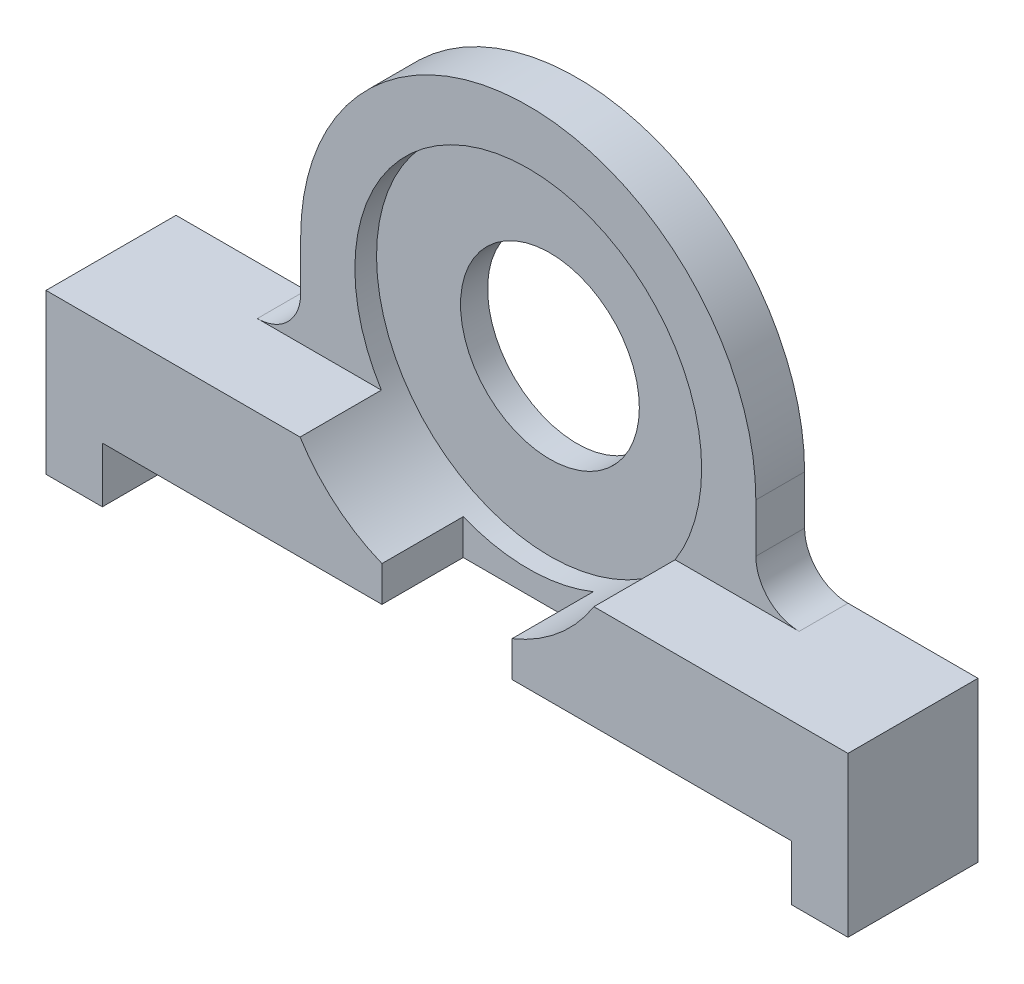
ISO-10303-21;
HEADER;
FILE_DESCRIPTION(('STEP AP214'),'2;1');
FILE_NAME('part.step','',(''),(''),'','','');
FILE_SCHEMA(('AUTOMOTIVE_DESIGN { 1 0 10303 214 1 1 1 1 }'));
ENDSEC;
DATA;
#1=APPLICATION_CONTEXT('core data for automotive mechanical design processes');
#2=APPLICATION_PROTOCOL_DEFINITION('international standard','automotive_design',2000,#1);
#3=PRODUCT_CONTEXT('',#1,'mechanical');
#4=PRODUCT('Part','Part','',(#3));
#5=PRODUCT_RELATED_PRODUCT_CATEGORY('part','',(#4));
#6=PRODUCT_DEFINITION_FORMATION('','',#4);
#7=PRODUCT_DEFINITION_CONTEXT('part definition',#1,'design');
#8=PRODUCT_DEFINITION('design','',#6,#7);
#9=PRODUCT_DEFINITION_SHAPE('','',#8);
#10=(LENGTH_UNIT() NAMED_UNIT(*) SI_UNIT(.MILLI.,.METRE.));
#11=(NAMED_UNIT(*) PLANE_ANGLE_UNIT() SI_UNIT($,.RADIAN.));
#12=(NAMED_UNIT(*) SI_UNIT($,.STERADIAN.) SOLID_ANGLE_UNIT());
#13=UNCERTAINTY_MEASURE_WITH_UNIT(LENGTH_MEASURE(1.E-05),#10,'distance_accuracy_value','');
#14=(GEOMETRIC_REPRESENTATION_CONTEXT(3) GLOBAL_UNCERTAINTY_ASSIGNED_CONTEXT((#13)) GLOBAL_UNIT_ASSIGNED_CONTEXT((#10,
#11,#12)) REPRESENTATION_CONTEXT('',''));
#15=CARTESIAN_POINT('',(0.,0.,0.));
#16=DIRECTION('',(0.,0.,1.));
#17=DIRECTION('',(1.,0.,0.));
#18=AXIS2_PLACEMENT_3D('',#15,#16,#17);
#19=CARTESIAN_POINT('',(0.,23.2,12.));
#20=DIRECTION('',(0.,0.,-1.));
#21=DIRECTION('',(-1.,0.,0.));
#22=AXIS2_PLACEMENT_3D('',#19,#20,#21);
#23=PLANE('',#22);
#24=DIRECTION('',(-1.,0.,0.));
#25=VECTOR('',#24,1.);
#26=CARTESIAN_POINT('',(-21.8,5.1,12.));
#27=LINE('',#26,#25);
#28=CARTESIAN_POINT('',(-6.,5.1,12.));
#29=VERTEX_POINT('',#28);
#30=CARTESIAN_POINT('',(-31.8,5.1,12.));
#31=VERTEX_POINT('',#30);
#32=EDGE_CURVE('E248',#29,#31,#27,.T.);
#33=ORIENTED_EDGE('',*,*,#32,.F.);
#34=DIRECTION('',(0.,-1.,0.));
#35=VECTOR('',#34,1.);
#36=CARTESIAN_POINT('',(-6.,5.1,12.));
#37=LINE('',#36,#35);
#38=CARTESIAN_POINT('',(-6.,8.36760302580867,12.));
#39=VERTEX_POINT('',#38);
#40=EDGE_CURVE('E235',#39,#29,#37,.T.);
#41=ORIENTED_EDGE('',*,*,#40,.F.);
#42=CARTESIAN_POINT('',(0.,23.2,12.));
#43=DIRECTION('',(0.,0.,1.));
#44=DIRECTION('',(1.,0.,0.));
#45=AXIS2_PLACEMENT_3D('',#42,#43,#44);
#46=CIRCLE('',#45,16.);
#47=CARTESIAN_POINT('',(-13.555441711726,14.7,12.));
#48=VERTEX_POINT('',#47);
#49=EDGE_CURVE('E301',#48,#39,#46,.T.);
#50=ORIENTED_EDGE('',*,*,#49,.F.);
#51=DIRECTION('',(-1.,0.,0.));
#52=VECTOR('',#51,1.);
#53=CARTESIAN_POINT('',(-21.,14.7,12.));
#54=LINE('',#53,#52);
#55=CARTESIAN_POINT('',(-37.,14.7,12.));
#56=VERTEX_POINT('',#55);
#57=EDGE_CURVE('E312',#48,#56,#54,.T.);
#58=ORIENTED_EDGE('',*,*,#57,.T.);
#59=DIRECTION('',(0.,-1.,0.));
#60=VECTOR('',#59,1.);
#61=CARTESIAN_POINT('',(-37.,14.7,12.));
#62=LINE('',#61,#60);
#63=CARTESIAN_POINT('',(-37.,0.,12.));
#64=VERTEX_POINT('',#63);
#65=EDGE_CURVE('E314',#56,#64,#62,.T.);
#66=ORIENTED_EDGE('',*,*,#65,.T.);
#67=DIRECTION('',(1.,0.,0.));
#68=VECTOR('',#67,1.);
#69=CARTESIAN_POINT('',(-37.,0.,12.));
#70=LINE('',#69,#68);
#71=CARTESIAN_POINT('',(-31.8,0.,12.));
#72=VERTEX_POINT('',#71);
#73=EDGE_CURVE('E304',#64,#72,#70,.T.);
#74=ORIENTED_EDGE('',*,*,#73,.T.);
#75=DIRECTION('',(0.,-1.,0.));
#76=VECTOR('',#75,1.);
#77=CARTESIAN_POINT('',(-31.8,0.,12.));
#78=LINE('',#77,#76);
#79=EDGE_CURVE('E257',#31,#72,#78,.T.);
#80=ORIENTED_EDGE('',*,*,#79,.F.);
#81=EDGE_LOOP('',(#33,#41,#50,#58,#66,#74,#80));
#82=FACE_BOUND('',#81,.T.);
#83=ADVANCED_FACE('F38',(#82),#23,.F.);
#84=CARTESIAN_POINT('',(21.,23.2,12.));
#85=DIRECTION('',(-1.,0.,0.));
#86=DIRECTION('',(0.,-1.,0.));
#87=AXIS2_PLACEMENT_3D('',#84,#85,#86);
#88=PLANE('',#87);
#89=DIRECTION('',(0.,-1.,0.));
#90=VECTOR('',#89,1.);
#91=CARTESIAN_POINT('',(21.,14.7,4.5));
#92=LINE('',#91,#90);
#93=CARTESIAN_POINT('',(21.,23.2,4.5));
#94=VERTEX_POINT('',#93);
#95=CARTESIAN_POINT('',(21.,18.7,4.5));
#96=VERTEX_POINT('',#95);
#97=EDGE_CURVE('E427',#94,#96,#92,.T.);
#98=ORIENTED_EDGE('',*,*,#97,.T.);
#99=DIRECTION('',(0.,0.,-1.));
#100=VECTOR('',#99,1.);
#101=CARTESIAN_POINT('',(21.,18.7,0.));
#102=LINE('',#101,#100);
#103=CARTESIAN_POINT('',(21.,18.7,0.));
#104=VERTEX_POINT('',#103);
#105=EDGE_CURVE('E384',#96,#104,#102,.T.);
#106=ORIENTED_EDGE('',*,*,#105,.T.);
#107=DIRECTION('',(0.,1.,0.));
#108=VECTOR('',#107,1.);
#109=CARTESIAN_POINT('',(21.,23.2,0.));
#110=LINE('',#109,#108);
#111=CARTESIAN_POINT('',(21.,23.2,0.));
#112=VERTEX_POINT('',#111);
#113=EDGE_CURVE('E325',#104,#112,#110,.T.);
#114=ORIENTED_EDGE('',*,*,#113,.T.);
#115=DIRECTION('',(0.,0.,-1.));
#116=VECTOR('',#115,1.);
#117=CARTESIAN_POINT('',(21.,23.2,12.));
#118=LINE('',#117,#116);
#119=EDGE_CURVE('E345',#94,#112,#118,.T.);
#120=ORIENTED_EDGE('',*,*,#119,.F.);
#121=EDGE_LOOP('',(#98,#106,#114,#120));
#122=FACE_BOUND('',#121,.T.);
#123=ADVANCED_FACE('F599',(#122),#88,.F.);
#124=CARTESIAN_POINT('',(0.,23.2,12.));
#125=DIRECTION('',(0.,0.,-1.));
#126=DIRECTION('',(-1.,0.,0.));
#127=AXIS2_PLACEMENT_3D('',#124,#125,#126);
#128=CYLINDRICAL_SURFACE('',#127,21.);
#129=CARTESIAN_POINT('',(0.,23.2,4.5));
#130=DIRECTION('',(0.,0.,1.));
#131=DIRECTION('',(1.,0.,0.));
#132=AXIS2_PLACEMENT_3D('',#129,#130,#131);
#133=CIRCLE('',#132,21.);
#134=CARTESIAN_POINT('',(-21.,23.2,4.5));
#135=VERTEX_POINT('',#134);
#136=EDGE_CURVE('E418',#135,#94,#133,.F.);
#137=ORIENTED_EDGE('',*,*,#136,.T.);
#138=ORIENTED_EDGE('',*,*,#119,.T.);
#139=CARTESIAN_POINT('',(0.,23.2,0.));
#140=DIRECTION('',(0.,0.,1.));
#141=DIRECTION('',(-1.,0.,0.));
#142=AXIS2_PLACEMENT_3D('',#139,#140,#141);
#143=CIRCLE('',#142,21.);
#144=CARTESIAN_POINT('',(-21.,23.2,0.));
#145=VERTEX_POINT('',#144);
#146=EDGE_CURVE('E327',#112,#145,#143,.T.);
#147=ORIENTED_EDGE('',*,*,#146,.T.);
#148=DIRECTION('',(0.,0.,-1.));
#149=VECTOR('',#148,1.);
#150=CARTESIAN_POINT('',(-21.,23.2,12.));
#151=LINE('',#150,#149);
#152=EDGE_CURVE('E343',#135,#145,#151,.T.);
#153=ORIENTED_EDGE('',*,*,#152,.F.);
#154=EDGE_LOOP('',(#137,#138,#147,#153));
#155=FACE_BOUND('',#154,.T.);
#156=ADVANCED_FACE('F604',(#155),#128,.T.);
#157=CARTESIAN_POINT('',(-21.,14.7,12.));
#158=DIRECTION('',(1.,0.,0.));
#159=DIRECTION('',(0.,0.,-1.));
#160=AXIS2_PLACEMENT_3D('',#157,#158,#159);
#161=PLANE('',#160);
#162=DIRECTION('',(0.,-1.,0.));
#163=VECTOR('',#162,1.);
#164=CARTESIAN_POINT('',(-21.,14.7,0.));
#165=LINE('',#164,#163);
#166=CARTESIAN_POINT('',(-21.,18.7,0.));
#167=VERTEX_POINT('',#166);
#168=EDGE_CURVE('E330',#145,#167,#165,.T.);
#169=ORIENTED_EDGE('',*,*,#168,.T.);
#170=DIRECTION('',(0.,0.,-1.));
#171=VECTOR('',#170,1.);
#172=CARTESIAN_POINT('',(-21.,18.7,4.5));
#173=LINE('',#172,#171);
#174=CARTESIAN_POINT('',(-21.,18.7,4.5));
#175=VERTEX_POINT('',#174);
#176=EDGE_CURVE('E393',#167,#175,#173,.F.);
#177=ORIENTED_EDGE('',*,*,#176,.T.);
#178=DIRECTION('',(0.,1.,0.));
#179=VECTOR('',#178,1.);
#180=CARTESIAN_POINT('',(-21.,23.2,4.5));
#181=LINE('',#180,#179);
#182=EDGE_CURVE('E416',#175,#135,#181,.T.);
#183=ORIENTED_EDGE('',*,*,#182,.T.);
#184=ORIENTED_EDGE('',*,*,#152,.T.);
#185=EDGE_LOOP('',(#169,#177,#183,#184));
#186=FACE_BOUND('',#185,.T.);
#187=ADVANCED_FACE('F408',(#186),#161,.F.);
#188=CARTESIAN_POINT('',(37.,0.,12.));
#189=DIRECTION('',(0.,1.,0.));
#190=DIRECTION('',(-1.,0.,0.));
#191=AXIS2_PLACEMENT_3D('',#188,#189,#190);
#192=PLANE('',#191);
#193=CARTESIAN_POINT('',(-34.,0.,3.));
#194=DIRECTION('',(0.,-1.,0.));
#195=DIRECTION('',(1.,0.,0.));
#196=AXIS2_PLACEMENT_3D('',#193,#194,#195);
#197=CIRCLE('',#196,1.25);
#198=CARTESIAN_POINT('',(-32.75,0.,3.));
#199=VERTEX_POINT('',#198);
#200=EDGE_CURVE('E435',#199,#199,#197,.T.);
#201=ORIENTED_EDGE('',*,*,#200,.F.);
#202=EDGE_LOOP('',(#201));
#203=FACE_BOUND('',#202,.T.);
#204=CARTESIAN_POINT('',(-34.,0.,9.));
#205=DIRECTION('',(0.,-1.,0.));
#206=DIRECTION('',(1.,0.,0.));
#207=AXIS2_PLACEMENT_3D('',#204,#205,#206);
#208=CIRCLE('',#207,1.25);
#209=CARTESIAN_POINT('',(-32.75,0.,9.));
#210=VERTEX_POINT('',#209);
#211=EDGE_CURVE('E434',#210,#210,#208,.T.);
#212=ORIENTED_EDGE('',*,*,#211,.F.);
#213=EDGE_LOOP('',(#212));
#214=FACE_BOUND('',#213,.T.);
#215=DIRECTION('',(1.,0.,0.));
#216=VECTOR('',#215,1.);
#217=CARTESIAN_POINT('',(-21.8,0.,5.));
#218=LINE('',#217,#216);
#219=CARTESIAN_POINT('',(-31.8,0.,5.));
#220=VERTEX_POINT('',#219);
#221=CARTESIAN_POINT('',(-21.8,0.,5.));
#222=VERTEX_POINT('',#221);
#223=EDGE_CURVE('E509',#220,#222,#218,.T.);
#224=ORIENTED_EDGE('',*,*,#223,.F.);
#225=DIRECTION('',(0.,0.,1.));
#226=VECTOR('',#225,1.);
#227=CARTESIAN_POINT('',(-31.8,0.,5.));
#228=LINE('',#227,#226);
#229=EDGE_CURVE('E505',#220,#72,#228,.T.);
#230=ORIENTED_EDGE('',*,*,#229,.T.);
#231=ORIENTED_EDGE('',*,*,#73,.F.);
#232=DIRECTION('',(0.,0.,-1.));
#233=VECTOR('',#232,1.);
#234=CARTESIAN_POINT('',(-37.,0.,12.));
#235=LINE('',#234,#233);
#236=CARTESIAN_POINT('',(-37.,0.,0.));
#237=VERTEX_POINT('',#236);
#238=EDGE_CURVE('E316',#64,#237,#235,.T.);
#239=ORIENTED_EDGE('',*,*,#238,.T.);
#240=DIRECTION('',(1.,0.,0.));
#241=VECTOR('',#240,1.);
#242=CARTESIAN_POINT('',(37.,0.,0.));
#243=LINE('',#242,#241);
#244=CARTESIAN_POINT('',(-27.,0.,0.));
#245=VERTEX_POINT('',#244);
#246=EDGE_CURVE('E317',#237,#245,#243,.T.);
#247=ORIENTED_EDGE('',*,*,#246,.T.);
#248=DIRECTION('',(0.,0.,-1.));
#249=VECTOR('',#248,1.);
#250=CARTESIAN_POINT('',(-27.,0.,1.));
#251=LINE('',#250,#249);
#252=CARTESIAN_POINT('',(-27.,0.,1.));
#253=VERTEX_POINT('',#252);
#254=EDGE_CURVE('E291',#253,#245,#251,.T.);
#255=ORIENTED_EDGE('',*,*,#254,.F.);
#256=DIRECTION('',(1.,0.,0.));
#257=VECTOR('',#256,1.);
#258=CARTESIAN_POINT('',(-27.,0.,1.));
#259=LINE('',#258,#257);
#260=CARTESIAN_POINT('',(-21.8,0.,1.));
#261=VERTEX_POINT('',#260);
#262=EDGE_CURVE('E273',#253,#261,#259,.T.);
#263=ORIENTED_EDGE('',*,*,#262,.T.);
#264=DIRECTION('',(0.,0.,-1.));
#265=VECTOR('',#264,1.);
#266=CARTESIAN_POINT('',(-21.8,0.,12.001));
#267=LINE('',#266,#265);
#268=EDGE_CURVE('E259',#222,#261,#267,.T.);
#269=ORIENTED_EDGE('',*,*,#268,.F.);
#270=EDGE_LOOP('',(#224,#230,#231,#239,#247,#255,#263,#269));
#271=FACE_BOUND('',#270,.T.);
#272=ADVANCED_FACE('F526',(#203,#214,#271),#192,.F.);
#273=CARTESIAN_POINT('',(0.,23.2,0.));
#274=DIRECTION('',(0.,0.,-1.));
#275=DIRECTION('',(-1.,0.,0.));
#276=AXIS2_PLACEMENT_3D('',#273,#274,#275);
#277=PLANE('',#276);
#278=CARTESIAN_POINT('',(0.,23.2,0.));
#279=DIRECTION('',(0.,0.,1.));
#280=DIRECTION('',(1.,0.,0.));
#281=AXIS2_PLACEMENT_3D('',#278,#279,#280);
#282=CIRCLE('',#281,8.25);
#283=CARTESIAN_POINT('',(8.25,23.2,0.));
#284=VERTEX_POINT('',#283);
#285=EDGE_CURVE('E294',#284,#284,#282,.T.);
#286=ORIENTED_EDGE('',*,*,#285,.T.);
#287=EDGE_LOOP('',(#286));
#288=FACE_BOUND('',#287,.T.);
#289=DIRECTION('',(0.,1.,0.));
#290=VECTOR('',#289,1.);
#291=CARTESIAN_POINT('',(27.,0.,0.));
#292=LINE('',#291,#290);
#293=CARTESIAN_POINT('',(27.,0.,0.));
#294=VERTEX_POINT('',#293);
#295=CARTESIAN_POINT('',(27.,8.7,0.));
#296=VERTEX_POINT('',#295);
#297=EDGE_CURVE('E284',#294,#296,#292,.T.);
#298=ORIENTED_EDGE('',*,*,#297,.T.);
#299=CARTESIAN_POINT('',(25.,8.7,0.));
#300=DIRECTION('',(0.,0.,-1.));
#301=DIRECTION('',(-1.,0.,0.));
#302=AXIS2_PLACEMENT_3D('',#299,#300,#301);
#303=CIRCLE('',#302,2.);
#304=CARTESIAN_POINT('',(25.,10.7,0.));
#305=VERTEX_POINT('',#304);
#306=EDGE_CURVE('E382',#296,#305,#303,.F.);
#307=ORIENTED_EDGE('',*,*,#306,.T.);
#308=DIRECTION('',(-1.,0.,0.));
#309=VECTOR('',#308,1.);
#310=CARTESIAN_POINT('',(-27.,10.7,0.));
#311=LINE('',#310,#309);
#312=CARTESIAN_POINT('',(-25.,10.7,0.));
#313=VERTEX_POINT('',#312);
#314=EDGE_CURVE('E272',#305,#313,#311,.T.);
#315=ORIENTED_EDGE('',*,*,#314,.T.);
#316=CARTESIAN_POINT('',(-25.,8.7,0.));
#317=DIRECTION('',(0.,0.,-1.));
#318=DIRECTION('',(-1.,0.,0.));
#319=AXIS2_PLACEMENT_3D('',#316,#317,#318);
#320=CIRCLE('',#319,2.);
#321=CARTESIAN_POINT('',(-27.,8.7,0.));
#322=VERTEX_POINT('',#321);
#323=EDGE_CURVE('E380',#313,#322,#320,.F.);
#324=ORIENTED_EDGE('',*,*,#323,.T.);
#325=DIRECTION('',(0.,-1.,0.));
#326=VECTOR('',#325,1.);
#327=CARTESIAN_POINT('',(-27.,0.,0.));
#328=LINE('',#327,#326);
#329=EDGE_CURVE('E262',#322,#245,#328,.T.);
#330=ORIENTED_EDGE('',*,*,#329,.T.);
#331=ORIENTED_EDGE('',*,*,#246,.F.);
#332=DIRECTION('',(0.,-1.,0.));
#333=VECTOR('',#332,1.);
#334=CARTESIAN_POINT('',(-37.,14.7,0.));
#335=LINE('',#334,#333);
#336=CARTESIAN_POINT('',(-37.,14.7,0.));
#337=VERTEX_POINT('',#336);
#338=EDGE_CURVE('E335',#337,#237,#335,.T.);
#339=ORIENTED_EDGE('',*,*,#338,.F.);
#340=DIRECTION('',(-1.,0.,0.));
#341=VECTOR('',#340,1.);
#342=CARTESIAN_POINT('',(-21.,14.7,0.));
#343=LINE('',#342,#341);
#344=CARTESIAN_POINT('',(-25.,14.7,0.));
#345=VERTEX_POINT('',#344);
#346=EDGE_CURVE('E333',#345,#337,#343,.T.);
#347=ORIENTED_EDGE('',*,*,#346,.F.);
#348=CARTESIAN_POINT('',(-25.,18.7,0.));
#349=DIRECTION('',(0.,0.,-1.));
#350=DIRECTION('',(-1.,0.,0.));
#351=AXIS2_PLACEMENT_3D('',#348,#349,#350);
#352=CIRCLE('',#351,4.);
#353=EDGE_CURVE('E46',#345,#167,#352,.F.);
#354=ORIENTED_EDGE('',*,*,#353,.T.);
#355=ORIENTED_EDGE('',*,*,#168,.F.);
#356=ORIENTED_EDGE('',*,*,#146,.F.);
#357=ORIENTED_EDGE('',*,*,#113,.F.);
#358=CARTESIAN_POINT('',(25.,18.7,0.));
#359=DIRECTION('',(0.,0.,-1.));
#360=DIRECTION('',(-1.,0.,0.));
#361=AXIS2_PLACEMENT_3D('',#358,#359,#360);
#362=CIRCLE('',#361,4.);
#363=CARTESIAN_POINT('',(25.,14.7,0.));
#364=VERTEX_POINT('',#363);
#365=EDGE_CURVE('E395',#104,#364,#362,.F.);
#366=ORIENTED_EDGE('',*,*,#365,.T.);
#367=DIRECTION('',(-1.,0.,0.));
#368=VECTOR('',#367,1.);
#369=CARTESIAN_POINT('',(21.,14.7,0.));
#370=LINE('',#369,#368);
#371=CARTESIAN_POINT('',(37.,14.7,0.));
#372=VERTEX_POINT('',#371);
#373=EDGE_CURVE('E322',#372,#364,#370,.T.);
#374=ORIENTED_EDGE('',*,*,#373,.F.);
#375=DIRECTION('',(0.,1.,0.));
#376=VECTOR('',#375,1.);
#377=CARTESIAN_POINT('',(37.,14.7,0.));
#378=LINE('',#377,#376);
#379=CARTESIAN_POINT('',(37.,0.,0.));
#380=VERTEX_POINT('',#379);
#381=EDGE_CURVE('E320',#380,#372,#378,.T.);
#382=ORIENTED_EDGE('',*,*,#381,.F.);
#383=EDGE_CURVE('E303',#294,#380,#243,.T.);
#384=ORIENTED_EDGE('',*,*,#383,.F.);
#385=EDGE_LOOP('',(#298,#307,#315,#324,#330,#331,#339,#347,#354,#355,#356,#357,#366,#374,#382,#384));
#386=FACE_BOUND('',#385,.T.);
#387=ADVANCED_FACE('F401',(#288,#386),#277,.T.);
#388=CARTESIAN_POINT('',(34.,0.,9.));
#389=DIRECTION('',(0.,-1.,0.));
#390=DIRECTION('',(-1.,0.,0.));
#391=AXIS2_PLACEMENT_3D('',#388,#389,#390);
#392=CIRCLE('',#391,1.25);
#393=CARTESIAN_POINT('',(32.75,0.,9.));
#394=VERTEX_POINT('',#393);
#395=EDGE_CURVE('E430',#394,#394,#392,.T.);
#396=ORIENTED_EDGE('',*,*,#395,.F.);
#397=EDGE_LOOP('',(#396));
#398=FACE_BOUND('',#397,.T.);
#399=CARTESIAN_POINT('',(34.,0.,3.));
#400=DIRECTION('',(0.,-1.,0.));
#401=DIRECTION('',(-1.,0.,0.));
#402=AXIS2_PLACEMENT_3D('',#399,#400,#401);
#403=CIRCLE('',#402,1.25);
#404=CARTESIAN_POINT('',(32.75,0.,3.));
#405=VERTEX_POINT('',#404);
#406=EDGE_CURVE('E441',#405,#405,#403,.T.);
#407=ORIENTED_EDGE('',*,*,#406,.F.);
#408=EDGE_LOOP('',(#407));
#409=FACE_BOUND('',#408,.T.);
#410=CARTESIAN_POINT('',(31.8,0.,12.));
#411=VERTEX_POINT('',#410);
#412=CARTESIAN_POINT('',(37.,0.,12.));
#413=VERTEX_POINT('',#412);
#414=EDGE_CURVE('E307',#411,#413,#70,.T.);
#415=ORIENTED_EDGE('',*,*,#414,.F.);
#416=DIRECTION('',(0.,0.,1.));
#417=VECTOR('',#416,1.);
#418=CARTESIAN_POINT('',(31.8,0.,5.));
#419=LINE('',#418,#417);
#420=CARTESIAN_POINT('',(31.8,0.,5.));
#421=VERTEX_POINT('',#420);
#422=EDGE_CURVE('E491',#421,#411,#419,.T.);
#423=ORIENTED_EDGE('',*,*,#422,.F.);
#424=DIRECTION('',(1.,0.,0.));
#425=VECTOR('',#424,1.);
#426=CARTESIAN_POINT('',(21.8,0.,5.));
#427=LINE('',#426,#425);
#428=CARTESIAN_POINT('',(21.8,0.,5.));
#429=VERTEX_POINT('',#428);
#430=EDGE_CURVE('E490',#429,#421,#427,.T.);
#431=ORIENTED_EDGE('',*,*,#430,.F.);
#432=DIRECTION('',(0.,0.,-1.));
#433=VECTOR('',#432,1.);
#434=CARTESIAN_POINT('',(21.8,0.,12.001));
#435=LINE('',#434,#433);
#436=CARTESIAN_POINT('',(21.8,0.,1.));
#437=VERTEX_POINT('',#436);
#438=EDGE_CURVE('E263',#429,#437,#435,.T.);
#439=ORIENTED_EDGE('',*,*,#438,.T.);
#440=CARTESIAN_POINT('',(27.,0.,1.));
#441=VERTEX_POINT('',#440);
#442=EDGE_CURVE('E271',#437,#441,#259,.T.);
#443=ORIENTED_EDGE('',*,*,#442,.T.);
#444=DIRECTION('',(0.,0.,-1.));
#445=VECTOR('',#444,1.);
#446=CARTESIAN_POINT('',(27.,0.,1.));
#447=LINE('',#446,#445);
#448=EDGE_CURVE('E282',#441,#294,#447,.T.);
#449=ORIENTED_EDGE('',*,*,#448,.T.);
#450=ORIENTED_EDGE('',*,*,#383,.T.);
#451=DIRECTION('',(0.,0.,-1.));
#452=VECTOR('',#451,1.);
#453=CARTESIAN_POINT('',(37.,0.,12.));
#454=LINE('',#453,#452);
#455=EDGE_CURVE('E351',#413,#380,#454,.T.);
#456=ORIENTED_EDGE('',*,*,#455,.F.);
#457=EDGE_LOOP('',(#415,#423,#431,#439,#443,#449,#450,#456));
#458=FACE_BOUND('',#457,.T.);
#459=ADVANCED_FACE('F487',(#398,#409,#458),#192,.F.);
#460=CARTESIAN_POINT('',(6.,8.36760302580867,12.));
#461=VERTEX_POINT('',#460);
#462=CARTESIAN_POINT('',(13.555441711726,14.7,12.));
#463=VERTEX_POINT('',#462);
#464=EDGE_CURVE('E298',#461,#463,#46,.T.);
#465=ORIENTED_EDGE('',*,*,#464,.F.);
#466=DIRECTION('',(0.,1.,0.));
#467=VECTOR('',#466,1.);
#468=CARTESIAN_POINT('',(6.,5.1,12.));
#469=LINE('',#468,#467);
#470=CARTESIAN_POINT('',(6.,5.1,12.));
#471=VERTEX_POINT('',#470);
#472=EDGE_CURVE('E243',#471,#461,#469,.T.);
#473=ORIENTED_EDGE('',*,*,#472,.F.);
#474=CARTESIAN_POINT('',(31.8,5.1,12.));
#475=VERTEX_POINT('',#474);
#476=EDGE_CURVE('E258',#475,#471,#27,.T.);
#477=ORIENTED_EDGE('',*,*,#476,.F.);
#478=DIRECTION('',(0.,1.,0.));
#479=VECTOR('',#478,1.);
#480=CARTESIAN_POINT('',(31.8,0.,12.));
#481=LINE('',#480,#479);
#482=EDGE_CURVE('E498',#411,#475,#481,.T.);
#483=ORIENTED_EDGE('',*,*,#482,.F.);
#484=ORIENTED_EDGE('',*,*,#414,.T.);
#485=DIRECTION('',(0.,1.,0.));
#486=VECTOR('',#485,1.);
#487=CARTESIAN_POINT('',(37.,14.7,12.));
#488=LINE('',#487,#486);
#489=CARTESIAN_POINT('',(37.,14.7,12.));
#490=VERTEX_POINT('',#489);
#491=EDGE_CURVE('E306',#413,#490,#488,.T.);
#492=ORIENTED_EDGE('',*,*,#491,.T.);
#493=DIRECTION('',(-1.,0.,0.));
#494=VECTOR('',#493,1.);
#495=CARTESIAN_POINT('',(21.,14.7,12.));
#496=LINE('',#495,#494);
#497=EDGE_CURVE('E309',#490,#463,#496,.T.);
#498=ORIENTED_EDGE('',*,*,#497,.T.);
#499=EDGE_LOOP('',(#465,#473,#477,#483,#484,#492,#498));
#500=FACE_BOUND('',#499,.T.);
#501=ADVANCED_FACE('F563',(#500),#23,.F.);
#502=CARTESIAN_POINT('',(37.,14.7,12.));
#503=DIRECTION('',(-1.,0.,0.));
#504=DIRECTION('',(0.,0.,1.));
#505=AXIS2_PLACEMENT_3D('',#502,#503,#504);
#506=PLANE('',#505);
#507=ORIENTED_EDGE('',*,*,#381,.T.);
#508=DIRECTION('',(0.,0.,-1.));
#509=VECTOR('',#508,1.);
#510=CARTESIAN_POINT('',(37.,14.7,12.));
#511=LINE('',#510,#509);
#512=EDGE_CURVE('E348',#490,#372,#511,.T.);
#513=ORIENTED_EDGE('',*,*,#512,.F.);
#514=ORIENTED_EDGE('',*,*,#491,.F.);
#515=ORIENTED_EDGE('',*,*,#455,.T.);
#516=EDGE_LOOP('',(#507,#513,#514,#515));
#517=FACE_BOUND('',#516,.T.);
#518=ADVANCED_FACE('F554',(#517),#506,.F.);
#519=CARTESIAN_POINT('',(21.,14.7,12.));
#520=DIRECTION('',(0.,-1.,0.));
#521=DIRECTION('',(1.,0.,0.));
#522=AXIS2_PLACEMENT_3D('',#519,#520,#521);
#523=PLANE('',#522);
#524=ORIENTED_EDGE('',*,*,#373,.T.);
#525=DIRECTION('',(0.,0.,-1.));
#526=VECTOR('',#525,1.);
#527=CARTESIAN_POINT('',(25.,14.7,4.5));
#528=LINE('',#527,#526);
#529=CARTESIAN_POINT('',(25.,14.7,4.5));
#530=VERTEX_POINT('',#529);
#531=EDGE_CURVE('E387',#364,#530,#528,.F.);
#532=ORIENTED_EDGE('',*,*,#531,.T.);
#533=DIRECTION('',(-1.,0.,0.));
#534=VECTOR('',#533,1.);
#535=CARTESIAN_POINT('',(-21.,14.7,4.5));
#536=LINE('',#535,#534);
#537=CARTESIAN_POINT('',(13.555441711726,14.7,4.5));
#538=VERTEX_POINT('',#537);
#539=EDGE_CURVE('E420',#530,#538,#536,.T.);
#540=ORIENTED_EDGE('',*,*,#539,.T.);
#541=DIRECTION('',(0.,0.,-1.));
#542=VECTOR('',#541,1.);
#543=CARTESIAN_POINT('',(13.555441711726,14.7,12.));
#544=LINE('',#543,#542);
#545=EDGE_CURVE('E360',#538,#463,#544,.F.);
#546=ORIENTED_EDGE('',*,*,#545,.T.);
#547=ORIENTED_EDGE('',*,*,#497,.F.);
#548=ORIENTED_EDGE('',*,*,#512,.T.);
#549=EDGE_LOOP('',(#524,#532,#540,#546,#547,#548));
#550=FACE_BOUND('',#549,.T.);
#551=ADVANCED_FACE('F558',(#550),#523,.F.);
#552=CARTESIAN_POINT('',(-21.,14.7,12.));
#553=DIRECTION('',(0.,-1.,0.));
#554=DIRECTION('',(1.,0.,0.));
#555=AXIS2_PLACEMENT_3D('',#552,#553,#554);
#556=PLANE('',#555);
#557=CARTESIAN_POINT('',(-13.555441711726,14.7,4.5));
#558=VERTEX_POINT('',#557);
#559=CARTESIAN_POINT('',(-25.,14.7,4.5));
#560=VERTEX_POINT('',#559);
#561=EDGE_CURVE('E414',#558,#560,#536,.T.);
#562=ORIENTED_EDGE('',*,*,#561,.T.);
#563=DIRECTION('',(0.,0.,-1.));
#564=VECTOR('',#563,1.);
#565=CARTESIAN_POINT('',(-25.,14.7,0.));
#566=LINE('',#565,#564);
#567=EDGE_CURVE('E390',#560,#345,#566,.T.);
#568=ORIENTED_EDGE('',*,*,#567,.T.);
#569=ORIENTED_EDGE('',*,*,#346,.T.);
#570=DIRECTION('',(0.,0.,-1.));
#571=VECTOR('',#570,1.);
#572=CARTESIAN_POINT('',(-37.,14.7,12.));
#573=LINE('',#572,#571);
#574=EDGE_CURVE('E340',#56,#337,#573,.T.);
#575=ORIENTED_EDGE('',*,*,#574,.F.);
#576=ORIENTED_EDGE('',*,*,#57,.F.);
#577=DIRECTION('',(0.,0.,-1.));
#578=VECTOR('',#577,1.);
#579=CARTESIAN_POINT('',(-13.555441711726,14.7,12.));
#580=LINE('',#579,#578);
#581=EDGE_CURVE('E363',#48,#558,#580,.T.);
#582=ORIENTED_EDGE('',*,*,#581,.T.);
#583=EDGE_LOOP('',(#562,#568,#569,#575,#576,#582));
#584=FACE_BOUND('',#583,.T.);
#585=ADVANCED_FACE('F681',(#584),#556,.F.);
#586=CARTESIAN_POINT('',(-37.,14.7,12.));
#587=DIRECTION('',(1.,0.,0.));
#588=DIRECTION('',(0.,0.,-1.));
#589=AXIS2_PLACEMENT_3D('',#586,#587,#588);
#590=PLANE('',#589);
#591=ORIENTED_EDGE('',*,*,#338,.T.);
#592=ORIENTED_EDGE('',*,*,#238,.F.);
#593=ORIENTED_EDGE('',*,*,#65,.F.);
#594=ORIENTED_EDGE('',*,*,#574,.T.);
#595=EDGE_LOOP('',(#591,#592,#593,#594));
#596=FACE_BOUND('',#595,.T.);
#597=ADVANCED_FACE('F677',(#596),#590,.F.);
#598=CARTESIAN_POINT('',(0.,23.2,12.));
#599=DIRECTION('',(0.,0.,-1.));
#600=DIRECTION('',(-1.,0.,0.));
#601=AXIS2_PLACEMENT_3D('',#598,#599,#600);
#602=CYLINDRICAL_SURFACE('',#601,16.);
#603=DIRECTION('',(0.,0.,1.));
#604=VECTOR('',#603,1.);
#605=CARTESIAN_POINT('',(-6.,8.36760302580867,-7.9369300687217));
#606=LINE('',#605,#604);
#607=CARTESIAN_POINT('',(-6.,8.36760302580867,4.5));
#608=VERTEX_POINT('',#607);
#609=EDGE_CURVE('E238',#608,#39,#606,.T.);
#610=ORIENTED_EDGE('',*,*,#609,.F.);
#611=CARTESIAN_POINT('',(0.,23.2,4.5));
#612=DIRECTION('',(0.,0.,1.));
#613=DIRECTION('',(1.,0.,0.));
#614=AXIS2_PLACEMENT_3D('',#611,#612,#613);
#615=CIRCLE('',#614,16.);
#616=CARTESIAN_POINT('',(6.,8.36760302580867,4.5));
#617=VERTEX_POINT('',#616);
#618=EDGE_CURVE('E518',#608,#617,#615,.T.);
#619=ORIENTED_EDGE('',*,*,#618,.T.);
#620=DIRECTION('',(0.,0.,1.));
#621=VECTOR('',#620,1.);
#622=CARTESIAN_POINT('',(6.,8.36760302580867,-7.9369300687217));
#623=LINE('',#622,#621);
#624=EDGE_CURVE('E571',#617,#461,#623,.T.);
#625=ORIENTED_EDGE('',*,*,#624,.T.);
#626=ORIENTED_EDGE('',*,*,#464,.T.);
#627=ORIENTED_EDGE('',*,*,#545,.F.);
#628=CARTESIAN_POINT('',(0.,23.2,4.5));
#629=DIRECTION('',(0.,0.,1.));
#630=DIRECTION('',(1.,0.,0.));
#631=AXIS2_PLACEMENT_3D('',#628,#629,#630);
#632=CIRCLE('',#631,16.);
#633=EDGE_CURVE('E357',#538,#558,#632,.T.);
#634=ORIENTED_EDGE('',*,*,#633,.T.);
#635=ORIENTED_EDGE('',*,*,#581,.F.);
#636=ORIENTED_EDGE('',*,*,#49,.T.);
#637=EDGE_LOOP('',(#610,#619,#625,#626,#627,#634,#635,#636));
#638=FACE_BOUND('',#637,.T.);
#639=CARTESIAN_POINT('',(0.,23.2,2.5));
#640=DIRECTION('',(0.,0.,1.));
#641=DIRECTION('',(1.,0.,0.));
#642=AXIS2_PLACEMENT_3D('',#639,#640,#641);
#643=CIRCLE('',#642,16.);
#644=CARTESIAN_POINT('',(16.,23.2,2.5));
#645=VERTEX_POINT('',#644);
#646=EDGE_CURVE('E354',#645,#645,#643,.T.);
#647=ORIENTED_EDGE('',*,*,#646,.F.);
#648=EDGE_LOOP('',(#647));
#649=FACE_BOUND('',#648,.T.);
#650=ADVANCED_FACE('F580',(#638,#649),#602,.F.);
#651=CARTESIAN_POINT('',(0.,23.2,2.5));
#652=DIRECTION('',(0.,0.,1.));
#653=DIRECTION('',(1.,0.,0.));
#654=AXIS2_PLACEMENT_3D('',#651,#652,#653);
#655=PLANE('',#654);
#656=ORIENTED_EDGE('',*,*,#646,.T.);
#657=EDGE_LOOP('',(#656));
#658=FACE_BOUND('',#657,.T.);
#659=CARTESIAN_POINT('',(0.,23.2,2.5));
#660=DIRECTION('',(0.,0.,1.));
#661=DIRECTION('',(1.,0.,0.));
#662=AXIS2_PLACEMENT_3D('',#659,#660,#661);
#663=CIRCLE('',#662,8.25);
#664=CARTESIAN_POINT('',(8.25,23.2,2.5));
#665=VERTEX_POINT('',#664);
#666=EDGE_CURVE('E295',#665,#665,#663,.T.);
#667=ORIENTED_EDGE('',*,*,#666,.F.);
#668=EDGE_LOOP('',(#667));
#669=FACE_BOUND('',#668,.T.);
#670=ADVANCED_FACE('F672',(#658,#669),#655,.T.);
#671=CARTESIAN_POINT('',(0.,23.2,2.5));
#672=DIRECTION('',(0.,0.,-1.));
#673=DIRECTION('',(-1.,0.,0.));
#674=AXIS2_PLACEMENT_3D('',#671,#672,#673);
#675=CYLINDRICAL_SURFACE('',#674,8.25);
#676=ORIENTED_EDGE('',*,*,#666,.T.);
#677=EDGE_LOOP('',(#676));
#678=FACE_BOUND('',#677,.T.);
#679=ORIENTED_EDGE('',*,*,#285,.F.);
#680=EDGE_LOOP('',(#679));
#681=FACE_BOUND('',#680,.T.);
#682=ADVANCED_FACE('F669',(#678,#681),#675,.F.);
#683=CARTESIAN_POINT('',(-27.,0.,1.));
#684=DIRECTION('',(1.,0.,0.));
#685=DIRECTION('',(0.,0.,-1.));
#686=AXIS2_PLACEMENT_3D('',#683,#684,#685);
#687=PLANE('',#686);
#688=ORIENTED_EDGE('',*,*,#329,.F.);
#689=DIRECTION('',(0.,0.,-1.));
#690=VECTOR('',#689,1.);
#691=CARTESIAN_POINT('',(-27.,8.7,1.));
#692=LINE('',#691,#690);
#693=CARTESIAN_POINT('',(-27.,8.7,1.));
#694=VERTEX_POINT('',#693);
#695=EDGE_CURVE('E371',#322,#694,#692,.F.);
#696=ORIENTED_EDGE('',*,*,#695,.T.);
#697=DIRECTION('',(0.,-1.,0.));
#698=VECTOR('',#697,1.);
#699=CARTESIAN_POINT('',(-27.,0.,1.));
#700=LINE('',#699,#698);
#701=EDGE_CURVE('E269',#694,#253,#700,.T.);
#702=ORIENTED_EDGE('',*,*,#701,.T.);
#703=ORIENTED_EDGE('',*,*,#254,.T.);
#704=EDGE_LOOP('',(#688,#696,#702,#703));
#705=FACE_BOUND('',#704,.T.);
#706=ADVANCED_FACE('F666',(#705),#687,.T.);
#707=CARTESIAN_POINT('',(27.,0.,1.));
#708=DIRECTION('',(-1.,0.,0.));
#709=DIRECTION('',(0.,-1.,0.));
#710=AXIS2_PLACEMENT_3D('',#707,#708,#709);
#711=PLANE('',#710);
#712=DIRECTION('',(0.,1.,0.));
#713=VECTOR('',#712,1.);
#714=CARTESIAN_POINT('',(27.,0.,1.));
#715=LINE('',#714,#713);
#716=CARTESIAN_POINT('',(27.,8.7,1.));
#717=VERTEX_POINT('',#716);
#718=EDGE_CURVE('E276',#441,#717,#715,.T.);
#719=ORIENTED_EDGE('',*,*,#718,.T.);
#720=DIRECTION('',(0.,0.,-1.));
#721=VECTOR('',#720,1.);
#722=CARTESIAN_POINT('',(27.,8.7,0.));
#723=LINE('',#722,#721);
#724=EDGE_CURVE('E377',#717,#296,#723,.T.);
#725=ORIENTED_EDGE('',*,*,#724,.T.);
#726=ORIENTED_EDGE('',*,*,#297,.F.);
#727=ORIENTED_EDGE('',*,*,#448,.F.);
#728=EDGE_LOOP('',(#719,#725,#726,#727));
#729=FACE_BOUND('',#728,.T.);
#730=ADVANCED_FACE('F547',(#729),#711,.T.);
#731=CARTESIAN_POINT('',(-27.,10.7,1.));
#732=DIRECTION('',(0.,-1.,0.));
#733=DIRECTION('',(0.,0.,-1.));
#734=AXIS2_PLACEMENT_3D('',#731,#732,#733);
#735=PLANE('',#734);
#736=DIRECTION('',(-1.,0.,0.));
#737=VECTOR('',#736,1.);
#738=CARTESIAN_POINT('',(-27.,10.7,1.));
#739=LINE('',#738,#737);
#740=CARTESIAN_POINT('',(25.,10.7,1.));
#741=VERTEX_POINT('',#740);
#742=CARTESIAN_POINT('',(-25.,10.7,1.));
#743=VERTEX_POINT('',#742);
#744=EDGE_CURVE('E279',#741,#743,#739,.T.);
#745=ORIENTED_EDGE('',*,*,#744,.T.);
#746=DIRECTION('',(0.,0.,-1.));
#747=VECTOR('',#746,1.);
#748=CARTESIAN_POINT('',(-25.,10.7,0.));
#749=LINE('',#748,#747);
#750=EDGE_CURVE('E368',#743,#313,#749,.T.);
#751=ORIENTED_EDGE('',*,*,#750,.T.);
#752=ORIENTED_EDGE('',*,*,#314,.F.);
#753=DIRECTION('',(0.,0.,-1.));
#754=VECTOR('',#753,1.);
#755=CARTESIAN_POINT('',(25.,10.7,1.));
#756=LINE('',#755,#754);
#757=EDGE_CURVE('E366',#305,#741,#756,.F.);
#758=ORIENTED_EDGE('',*,*,#757,.T.);
#759=EDGE_LOOP('',(#745,#751,#752,#758));
#760=FACE_BOUND('',#759,.T.);
#761=ADVANCED_FACE('F538',(#760),#735,.T.);
#762=CARTESIAN_POINT('',(0.,0.,1.));
#763=DIRECTION('',(0.,0.,-1.));
#764=DIRECTION('',(-1.,0.,0.));
#765=AXIS2_PLACEMENT_3D('',#762,#763,#764);
#766=PLANE('',#765);
#767=ORIENTED_EDGE('',*,*,#701,.F.);
#768=CARTESIAN_POINT('',(-25.,8.7,1.));
#769=DIRECTION('',(0.,0.,-1.));
#770=DIRECTION('',(-1.,0.,0.));
#771=AXIS2_PLACEMENT_3D('',#768,#769,#770);
#772=CIRCLE('',#771,2.);
#773=EDGE_CURVE('E375',#694,#743,#772,.T.);
#774=ORIENTED_EDGE('',*,*,#773,.T.);
#775=ORIENTED_EDGE('',*,*,#744,.F.);
#776=CARTESIAN_POINT('',(25.,8.7,1.));
#777=DIRECTION('',(0.,0.,-1.));
#778=DIRECTION('',(-1.,0.,0.));
#779=AXIS2_PLACEMENT_3D('',#776,#777,#778);
#780=CIRCLE('',#779,2.);
#781=EDGE_CURVE('E373',#741,#717,#780,.T.);
#782=ORIENTED_EDGE('',*,*,#781,.T.);
#783=ORIENTED_EDGE('',*,*,#718,.F.);
#784=ORIENTED_EDGE('',*,*,#442,.F.);
#785=DIRECTION('',(0.,-1.,0.));
#786=VECTOR('',#785,1.);
#787=CARTESIAN_POINT('',(21.8,0.,1.));
#788=LINE('',#787,#786);
#789=CARTESIAN_POINT('',(21.8,5.1,1.));
#790=VERTEX_POINT('',#789);
#791=EDGE_CURVE('E460',#790,#437,#788,.T.);
#792=ORIENTED_EDGE('',*,*,#791,.F.);
#793=DIRECTION('',(1.,0.,0.));
#794=VECTOR('',#793,1.);
#795=CARTESIAN_POINT('',(-21.8,5.1,1.));
#796=LINE('',#795,#794);
#797=CARTESIAN_POINT('',(-21.8,5.1,1.));
#798=VERTEX_POINT('',#797);
#799=EDGE_CURVE('E457',#798,#790,#796,.T.);
#800=ORIENTED_EDGE('',*,*,#799,.F.);
#801=DIRECTION('',(0.,1.,0.));
#802=VECTOR('',#801,1.);
#803=CARTESIAN_POINT('',(-21.8,0.,1.));
#804=LINE('',#803,#802);
#805=EDGE_CURVE('E452',#261,#798,#804,.T.);
#806=ORIENTED_EDGE('',*,*,#805,.F.);
#807=ORIENTED_EDGE('',*,*,#262,.F.);
#808=EDGE_LOOP('',(#767,#774,#775,#782,#783,#784,#792,#800,#806,#807));
#809=FACE_BOUND('',#808,.T.);
#810=ADVANCED_FACE('F478',(#809),#766,.T.);
#811=CARTESIAN_POINT('',(-21.8,0.,12.001));
#812=DIRECTION('',(-1.,0.,0.));
#813=DIRECTION('',(0.,0.,1.));
#814=AXIS2_PLACEMENT_3D('',#811,#812,#813);
#815=PLANE('',#814);
#816=DIRECTION('',(0.,0.,-1.));
#817=VECTOR('',#816,1.);
#818=CARTESIAN_POINT('',(-21.8,5.1,12.001));
#819=LINE('',#818,#817);
#820=CARTESIAN_POINT('',(-21.8,5.1,5.));
#821=VERTEX_POINT('',#820);
#822=EDGE_CURVE('E267',#821,#798,#819,.T.);
#823=ORIENTED_EDGE('',*,*,#822,.F.);
#824=DIRECTION('',(0.,1.,0.));
#825=VECTOR('',#824,1.);
#826=CARTESIAN_POINT('',(-21.8,0.,5.));
#827=LINE('',#826,#825);
#828=EDGE_CURVE('E61',#222,#821,#827,.T.);
#829=ORIENTED_EDGE('',*,*,#828,.F.);
#830=ORIENTED_EDGE('',*,*,#268,.T.);
#831=ORIENTED_EDGE('',*,*,#805,.T.);
#832=EDGE_LOOP('',(#823,#829,#830,#831));
#833=FACE_BOUND('',#832,.T.);
#834=ADVANCED_FACE('F473',(#833),#815,.F.);
#835=CARTESIAN_POINT('',(21.8,0.,12.001));
#836=DIRECTION('',(1.,0.,0.));
#837=DIRECTION('',(0.,0.,-1.));
#838=AXIS2_PLACEMENT_3D('',#835,#836,#837);
#839=PLANE('',#838);
#840=ORIENTED_EDGE('',*,*,#438,.F.);
#841=DIRECTION('',(0.,-1.,0.));
#842=VECTOR('',#841,1.);
#843=CARTESIAN_POINT('',(21.8,0.,5.));
#844=LINE('',#843,#842);
#845=CARTESIAN_POINT('',(21.8,5.1,5.));
#846=VERTEX_POINT('',#845);
#847=EDGE_CURVE('E483',#846,#429,#844,.T.);
#848=ORIENTED_EDGE('',*,*,#847,.F.);
#849=DIRECTION('',(0.,0.,-1.));
#850=VECTOR('',#849,1.);
#851=CARTESIAN_POINT('',(21.8,5.1,12.001));
#852=LINE('',#851,#850);
#853=EDGE_CURVE('E463',#846,#790,#852,.T.);
#854=ORIENTED_EDGE('',*,*,#853,.T.);
#855=ORIENTED_EDGE('',*,*,#791,.T.);
#856=EDGE_LOOP('',(#840,#848,#854,#855));
#857=FACE_BOUND('',#856,.T.);
#858=ADVANCED_FACE('F482',(#857),#839,.F.);
#859=CARTESIAN_POINT('',(-21.8,5.1,12.001));
#860=DIRECTION('',(0.,1.,0.));
#861=DIRECTION('',(0.,0.,1.));
#862=AXIS2_PLACEMENT_3D('',#859,#860,#861);
#863=PLANE('',#862);
#864=DIRECTION('',(-1.,0.,0.));
#865=VECTOR('',#864,1.);
#866=CARTESIAN_POINT('',(-6.,5.1,4.5));
#867=LINE('',#866,#865);
#868=CARTESIAN_POINT('',(6.,5.1,4.5));
#869=VERTEX_POINT('',#868);
#870=CARTESIAN_POINT('',(-6.,5.1,4.5));
#871=VERTEX_POINT('',#870);
#872=EDGE_CURVE('E252',#869,#871,#867,.T.);
#873=ORIENTED_EDGE('',*,*,#872,.T.);
#874=DIRECTION('',(0.,0.,1.));
#875=VECTOR('',#874,1.);
#876=CARTESIAN_POINT('',(-6.,5.1,-7.9369300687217));
#877=LINE('',#876,#875);
#878=EDGE_CURVE('E53',#871,#29,#877,.T.);
#879=ORIENTED_EDGE('',*,*,#878,.T.);
#880=ORIENTED_EDGE('',*,*,#32,.T.);
#881=DIRECTION('',(0.,0.,1.));
#882=VECTOR('',#881,1.);
#883=CARTESIAN_POINT('',(-31.8,5.1,5.));
#884=LINE('',#883,#882);
#885=CARTESIAN_POINT('',(-31.8,5.1,5.));
#886=VERTEX_POINT('',#885);
#887=EDGE_CURVE('E516',#886,#31,#884,.T.);
#888=ORIENTED_EDGE('',*,*,#887,.F.);
#889=DIRECTION('',(-1.,0.,0.));
#890=VECTOR('',#889,1.);
#891=CARTESIAN_POINT('',(-21.8,5.1,5.));
#892=LINE('',#891,#890);
#893=EDGE_CURVE('E470',#821,#886,#892,.T.);
#894=ORIENTED_EDGE('',*,*,#893,.F.);
#895=ORIENTED_EDGE('',*,*,#822,.T.);
#896=ORIENTED_EDGE('',*,*,#799,.T.);
#897=ORIENTED_EDGE('',*,*,#853,.F.);
#898=DIRECTION('',(-1.,0.,0.));
#899=VECTOR('',#898,1.);
#900=CARTESIAN_POINT('',(21.8,5.1,5.));
#901=LINE('',#900,#899);
#902=CARTESIAN_POINT('',(31.8,5.1,5.));
#903=VERTEX_POINT('',#902);
#904=EDGE_CURVE('E496',#903,#846,#901,.T.);
#905=ORIENTED_EDGE('',*,*,#904,.F.);
#906=DIRECTION('',(0.,0.,1.));
#907=VECTOR('',#906,1.);
#908=CARTESIAN_POINT('',(31.8,5.1,5.));
#909=LINE('',#908,#907);
#910=EDGE_CURVE('E422',#903,#475,#909,.T.);
#911=ORIENTED_EDGE('',*,*,#910,.T.);
#912=ORIENTED_EDGE('',*,*,#476,.T.);
#913=DIRECTION('',(0.,0.,1.));
#914=VECTOR('',#913,1.);
#915=CARTESIAN_POINT('',(6.,5.1,-7.9369300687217));
#916=LINE('',#915,#914);
#917=EDGE_CURVE('E253',#869,#471,#916,.T.);
#918=ORIENTED_EDGE('',*,*,#917,.F.);
#919=EDGE_LOOP('',(#873,#879,#880,#888,#894,#895,#896,#897,#905,#911,#912,#918));
#920=FACE_BOUND('',#919,.T.);
#921=ADVANCED_FACE('F247',(#920),#863,.F.);
#922=CARTESIAN_POINT('',(34.,8.99999999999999,3.));
#923=DIRECTION('',(0.,-1.,0.));
#924=DIRECTION('',(1.,0.,0.));
#925=AXIS2_PLACEMENT_3D('',#922,#923,#924);
#926=CYLINDRICAL_SURFACE('',#925,1.25);
#927=CARTESIAN_POINT('',(34.,8.99999999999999,3.));
#928=DIRECTION('',(0.,-1.,0.));
#929=DIRECTION('',(-1.,0.,0.));
#930=AXIS2_PLACEMENT_3D('',#927,#928,#929);
#931=CIRCLE('',#930,1.25);
#932=CARTESIAN_POINT('',(32.75,8.99999999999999,3.));
#933=VERTEX_POINT('',#932);
#934=EDGE_CURVE('E438',#933,#933,#931,.T.);
#935=ORIENTED_EDGE('',*,*,#934,.F.);
#936=EDGE_LOOP('',(#935));
#937=FACE_BOUND('',#936,.T.);
#938=ORIENTED_EDGE('',*,*,#406,.T.);
#939=EDGE_LOOP('',(#938));
#940=FACE_BOUND('',#939,.T.);
#941=ADVANCED_FACE('F657',(#937,#940),#926,.F.);
#942=CARTESIAN_POINT('',(34.,8.99999999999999,3.));
#943=DIRECTION('',(0.,1.,0.));
#944=DIRECTION('',(-1.,0.,0.));
#945=AXIS2_PLACEMENT_3D('',#942,#943,#944);
#946=PLANE('',#945);
#947=ORIENTED_EDGE('',*,*,#934,.T.);
#948=EDGE_LOOP('',(#947));
#949=FACE_BOUND('',#948,.T.);
#950=ADVANCED_FACE('F836',(#949),#946,.F.);
#951=CARTESIAN_POINT('',(34.,8.99999999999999,9.));
#952=DIRECTION('',(0.,-1.,0.));
#953=DIRECTION('',(1.,0.,0.));
#954=AXIS2_PLACEMENT_3D('',#951,#952,#953);
#955=CYLINDRICAL_SURFACE('',#954,1.25);
#956=CARTESIAN_POINT('',(34.,8.99999999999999,9.));
#957=DIRECTION('',(0.,-1.,0.));
#958=DIRECTION('',(-1.,0.,0.));
#959=AXIS2_PLACEMENT_3D('',#956,#957,#958);
#960=CIRCLE('',#959,1.25);
#961=CARTESIAN_POINT('',(32.75,8.99999999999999,9.));
#962=VERTEX_POINT('',#961);
#963=EDGE_CURVE('E444',#962,#962,#960,.T.);
#964=ORIENTED_EDGE('',*,*,#963,.F.);
#965=EDGE_LOOP('',(#964));
#966=FACE_BOUND('',#965,.T.);
#967=ORIENTED_EDGE('',*,*,#395,.T.);
#968=EDGE_LOOP('',(#967));
#969=FACE_BOUND('',#968,.T.);
#970=ADVANCED_FACE('F647',(#966,#969),#955,.F.);
#971=CARTESIAN_POINT('',(34.,8.99999999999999,9.));
#972=DIRECTION('',(0.,1.,0.));
#973=DIRECTION('',(-1.,0.,0.));
#974=AXIS2_PLACEMENT_3D('',#971,#972,#973);
#975=PLANE('',#974);
#976=ORIENTED_EDGE('',*,*,#963,.T.);
#977=EDGE_LOOP('',(#976));
#978=FACE_BOUND('',#977,.T.);
#979=ADVANCED_FACE('F637',(#978),#975,.F.);
#980=CARTESIAN_POINT('',(-34.,9.00000000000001,9.));
#981=DIRECTION('',(0.,-1.,0.));
#982=DIRECTION('',(1.,0.,0.));
#983=AXIS2_PLACEMENT_3D('',#980,#981,#982);
#984=CYLINDRICAL_SURFACE('',#983,1.25);
#985=CARTESIAN_POINT('',(-34.,9.00000000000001,9.));
#986=DIRECTION('',(0.,-1.,0.));
#987=DIRECTION('',(1.,0.,0.));
#988=AXIS2_PLACEMENT_3D('',#985,#986,#987);
#989=CIRCLE('',#988,1.25);
#990=CARTESIAN_POINT('',(-32.75,9.00000000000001,9.));
#991=VERTEX_POINT('',#990);
#992=EDGE_CURVE('E449',#991,#991,#989,.T.);
#993=ORIENTED_EDGE('',*,*,#992,.F.);
#994=EDGE_LOOP('',(#993));
#995=FACE_BOUND('',#994,.T.);
#996=ORIENTED_EDGE('',*,*,#211,.T.);
#997=EDGE_LOOP('',(#996));
#998=FACE_BOUND('',#997,.T.);
#999=ADVANCED_FACE('F634',(#995,#998),#984,.F.);
#1000=CARTESIAN_POINT('',(-34.,9.00000000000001,9.));
#1001=DIRECTION('',(0.,-1.,0.));
#1002=DIRECTION('',(1.,0.,0.));
#1003=AXIS2_PLACEMENT_3D('',#1000,#1001,#1002);
#1004=PLANE('',#1003);
#1005=ORIENTED_EDGE('',*,*,#992,.T.);
#1006=EDGE_LOOP('',(#1005));
#1007=FACE_BOUND('',#1006,.T.);
#1008=ADVANCED_FACE('F636',(#1007),#1004,.T.);
#1009=CARTESIAN_POINT('',(-34.,9.00000000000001,3.));
#1010=DIRECTION('',(0.,-1.,0.));
#1011=DIRECTION('',(1.,0.,0.));
#1012=AXIS2_PLACEMENT_3D('',#1009,#1010,#1011);
#1013=CYLINDRICAL_SURFACE('',#1012,1.25);
#1014=CARTESIAN_POINT('',(-34.,9.00000000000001,3.));
#1015=DIRECTION('',(0.,-1.,0.));
#1016=DIRECTION('',(1.,0.,0.));
#1017=AXIS2_PLACEMENT_3D('',#1014,#1015,#1016);
#1018=CIRCLE('',#1017,1.25);
#1019=CARTESIAN_POINT('',(-32.75,9.00000000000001,3.));
#1020=VERTEX_POINT('',#1019);
#1021=EDGE_CURVE('E431',#1020,#1020,#1018,.T.);
#1022=ORIENTED_EDGE('',*,*,#1021,.F.);
#1023=EDGE_LOOP('',(#1022));
#1024=FACE_BOUND('',#1023,.T.);
#1025=ORIENTED_EDGE('',*,*,#200,.T.);
#1026=EDGE_LOOP('',(#1025));
#1027=FACE_BOUND('',#1026,.T.);
#1028=ADVANCED_FACE('F644',(#1024,#1027),#1013,.F.);
#1029=CARTESIAN_POINT('',(-34.,9.00000000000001,3.));
#1030=DIRECTION('',(0.,-1.,0.));
#1031=DIRECTION('',(1.,0.,0.));
#1032=AXIS2_PLACEMENT_3D('',#1029,#1030,#1031);
#1033=PLANE('',#1032);
#1034=ORIENTED_EDGE('',*,*,#1021,.T.);
#1035=EDGE_LOOP('',(#1034));
#1036=FACE_BOUND('',#1035,.T.);
#1037=ADVANCED_FACE('F713',(#1036),#1033,.T.);
#1038=CARTESIAN_POINT('',(0.,23.2,4.5));
#1039=DIRECTION('',(0.,0.,1.));
#1040=DIRECTION('',(1.,0.,0.));
#1041=AXIS2_PLACEMENT_3D('',#1038,#1039,#1040);
#1042=PLANE('',#1041);
#1043=ORIENTED_EDGE('',*,*,#539,.F.);
#1044=CARTESIAN_POINT('',(25.,18.7,4.5));
#1045=DIRECTION('',(0.,0.,1.));
#1046=DIRECTION('',(1.,0.,0.));
#1047=AXIS2_PLACEMENT_3D('',#1044,#1045,#1046);
#1048=CIRCLE('',#1047,4.);
#1049=EDGE_CURVE('E397',#530,#96,#1048,.F.);
#1050=ORIENTED_EDGE('',*,*,#1049,.T.);
#1051=ORIENTED_EDGE('',*,*,#97,.F.);
#1052=ORIENTED_EDGE('',*,*,#136,.F.);
#1053=ORIENTED_EDGE('',*,*,#182,.F.);
#1054=CARTESIAN_POINT('',(-25.,18.7,4.5));
#1055=DIRECTION('',(0.,0.,1.));
#1056=DIRECTION('',(1.,0.,0.));
#1057=AXIS2_PLACEMENT_3D('',#1054,#1055,#1056);
#1058=CIRCLE('',#1057,4.);
#1059=EDGE_CURVE('E13',#175,#560,#1058,.F.);
#1060=ORIENTED_EDGE('',*,*,#1059,.T.);
#1061=ORIENTED_EDGE('',*,*,#561,.F.);
#1062=ORIENTED_EDGE('',*,*,#633,.F.);
#1063=EDGE_LOOP('',(#1043,#1050,#1051,#1052,#1053,#1060,#1061,#1062));
#1064=FACE_BOUND('',#1063,.T.);
#1065=ADVANCED_FACE('F413',(#1064),#1042,.T.);
#1066=CARTESIAN_POINT('',(-25.,8.7,1.));
#1067=DIRECTION('',(0.,0.,1.));
#1068=DIRECTION('',(1.,0.,0.));
#1069=AXIS2_PLACEMENT_3D('',#1066,#1067,#1068);
#1070=CYLINDRICAL_SURFACE('',#1069,2.);
#1071=ORIENTED_EDGE('',*,*,#773,.F.);
#1072=ORIENTED_EDGE('',*,*,#695,.F.);
#1073=ORIENTED_EDGE('',*,*,#323,.F.);
#1074=ORIENTED_EDGE('',*,*,#750,.F.);
#1075=EDGE_LOOP('',(#1071,#1072,#1073,#1074));
#1076=FACE_BOUND('',#1075,.T.);
#1077=ADVANCED_FACE('F535',(#1076),#1070,.F.);
#1078=CARTESIAN_POINT('',(25.,8.7,1.));
#1079=DIRECTION('',(0.,0.,1.));
#1080=DIRECTION('',(1.,0.,0.));
#1081=AXIS2_PLACEMENT_3D('',#1078,#1079,#1080);
#1082=CYLINDRICAL_SURFACE('',#1081,2.);
#1083=ORIENTED_EDGE('',*,*,#781,.F.);
#1084=ORIENTED_EDGE('',*,*,#757,.F.);
#1085=ORIENTED_EDGE('',*,*,#306,.F.);
#1086=ORIENTED_EDGE('',*,*,#724,.F.);
#1087=EDGE_LOOP('',(#1083,#1084,#1085,#1086));
#1088=FACE_BOUND('',#1087,.T.);
#1089=ADVANCED_FACE('F545',(#1088),#1082,.F.);
#1090=CARTESIAN_POINT('',(25.,18.7,12.));
#1091=DIRECTION('',(0.,0.,1.));
#1092=DIRECTION('',(1.,0.,0.));
#1093=AXIS2_PLACEMENT_3D('',#1090,#1091,#1092);
#1094=CYLINDRICAL_SURFACE('',#1093,4.);
#1095=ORIENTED_EDGE('',*,*,#1049,.F.);
#1096=ORIENTED_EDGE('',*,*,#531,.F.);
#1097=ORIENTED_EDGE('',*,*,#365,.F.);
#1098=ORIENTED_EDGE('',*,*,#105,.F.);
#1099=EDGE_LOOP('',(#1095,#1096,#1097,#1098));
#1100=FACE_BOUND('',#1099,.T.);
#1101=ADVANCED_FACE('F721',(#1100),#1094,.F.);
#1102=CARTESIAN_POINT('',(-25.,18.7,12.));
#1103=DIRECTION('',(0.,0.,1.));
#1104=DIRECTION('',(1.,0.,0.));
#1105=AXIS2_PLACEMENT_3D('',#1102,#1103,#1104);
#1106=CYLINDRICAL_SURFACE('',#1105,4.);
#1107=ORIENTED_EDGE('',*,*,#1059,.F.);
#1108=ORIENTED_EDGE('',*,*,#176,.F.);
#1109=ORIENTED_EDGE('',*,*,#353,.F.);
#1110=ORIENTED_EDGE('',*,*,#567,.F.);
#1111=EDGE_LOOP('',(#1107,#1108,#1109,#1110));
#1112=FACE_BOUND('',#1111,.T.);
#1113=ADVANCED_FACE('F40',(#1112),#1106,.F.);
#1114=CARTESIAN_POINT('',(-31.8,0.,5.));
#1115=DIRECTION('',(-1.,0.,0.));
#1116=DIRECTION('',(0.,0.,1.));
#1117=AXIS2_PLACEMENT_3D('',#1114,#1115,#1116);
#1118=PLANE('',#1117);
#1119=ORIENTED_EDGE('',*,*,#79,.T.);
#1120=ORIENTED_EDGE('',*,*,#229,.F.);
#1121=DIRECTION('',(0.,-1.,0.));
#1122=VECTOR('',#1121,1.);
#1123=CARTESIAN_POINT('',(-31.8,0.,5.));
#1124=LINE('',#1123,#1122);
#1125=EDGE_CURVE('E513',#886,#220,#1124,.T.);
#1126=ORIENTED_EDGE('',*,*,#1125,.F.);
#1127=ORIENTED_EDGE('',*,*,#887,.T.);
#1128=EDGE_LOOP('',(#1119,#1120,#1126,#1127));
#1129=FACE_BOUND('',#1128,.T.);
#1130=ADVANCED_FACE('F522',(#1129),#1118,.F.);
#1131=CARTESIAN_POINT('',(0.,0.,5.));
#1132=DIRECTION('',(0.,0.,-1.));
#1133=DIRECTION('',(-1.,0.,0.));
#1134=AXIS2_PLACEMENT_3D('',#1131,#1132,#1133);
#1135=PLANE('',#1134);
#1136=ORIENTED_EDGE('',*,*,#223,.T.);
#1137=ORIENTED_EDGE('',*,*,#828,.T.);
#1138=ORIENTED_EDGE('',*,*,#893,.T.);
#1139=ORIENTED_EDGE('',*,*,#1125,.T.);
#1140=EDGE_LOOP('',(#1136,#1137,#1138,#1139));
#1141=FACE_BOUND('',#1140,.T.);
#1142=ADVANCED_FACE('F523',(#1141),#1135,.F.);
#1143=CARTESIAN_POINT('',(31.8,0.,5.));
#1144=DIRECTION('',(1.,0.,0.));
#1145=DIRECTION('',(0.,0.,-1.));
#1146=AXIS2_PLACEMENT_3D('',#1143,#1144,#1145);
#1147=PLANE('',#1146);
#1148=ORIENTED_EDGE('',*,*,#482,.T.);
#1149=ORIENTED_EDGE('',*,*,#910,.F.);
#1150=DIRECTION('',(0.,1.,0.));
#1151=VECTOR('',#1150,1.);
#1152=CARTESIAN_POINT('',(31.8,0.,5.));
#1153=LINE('',#1152,#1151);
#1154=EDGE_CURVE('E494',#421,#903,#1153,.T.);
#1155=ORIENTED_EDGE('',*,*,#1154,.F.);
#1156=ORIENTED_EDGE('',*,*,#422,.T.);
#1157=EDGE_LOOP('',(#1148,#1149,#1155,#1156));
#1158=FACE_BOUND('',#1157,.T.);
#1159=ADVANCED_FACE('F567',(#1158),#1147,.F.);
#1160=CARTESIAN_POINT('',(0.,0.,5.));
#1161=DIRECTION('',(0.,0.,-1.));
#1162=DIRECTION('',(-1.,0.,0.));
#1163=AXIS2_PLACEMENT_3D('',#1160,#1161,#1162);
#1164=PLANE('',#1163);
#1165=ORIENTED_EDGE('',*,*,#847,.T.);
#1166=ORIENTED_EDGE('',*,*,#430,.T.);
#1167=ORIENTED_EDGE('',*,*,#1154,.T.);
#1168=ORIENTED_EDGE('',*,*,#904,.T.);
#1169=EDGE_LOOP('',(#1165,#1166,#1167,#1168));
#1170=FACE_BOUND('',#1169,.T.);
#1171=ADVANCED_FACE('F569',(#1170),#1164,.F.);
#1172=CARTESIAN_POINT('',(-6.,5.1,-7.9369300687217));
#1173=DIRECTION('',(-1.,0.,0.));
#1174=DIRECTION('',(0.,-1.,0.));
#1175=AXIS2_PLACEMENT_3D('',#1172,#1173,#1174);
#1176=PLANE('',#1175);
#1177=DIRECTION('',(0.,1.,0.));
#1178=VECTOR('',#1177,1.);
#1179=CARTESIAN_POINT('',(-6.,5.1,4.5));
#1180=LINE('',#1179,#1178);
#1181=EDGE_CURVE('E577',#871,#608,#1180,.T.);
#1182=ORIENTED_EDGE('',*,*,#1181,.T.);
#1183=ORIENTED_EDGE('',*,*,#609,.T.);
#1184=ORIENTED_EDGE('',*,*,#40,.T.);
#1185=ORIENTED_EDGE('',*,*,#878,.F.);
#1186=EDGE_LOOP('',(#1182,#1183,#1184,#1185));
#1187=FACE_BOUND('',#1186,.T.);
#1188=ADVANCED_FACE('F236',(#1187),#1176,.F.);
#1189=CARTESIAN_POINT('',(6.,5.1,-7.9369300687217));
#1190=DIRECTION('',(1.,0.,0.));
#1191=DIRECTION('',(0.,1.,0.));
#1192=AXIS2_PLACEMENT_3D('',#1189,#1190,#1191);
#1193=PLANE('',#1192);
#1194=DIRECTION('',(0.,-1.,0.));
#1195=VECTOR('',#1194,1.);
#1196=CARTESIAN_POINT('',(6.,5.1,4.5));
#1197=LINE('',#1196,#1195);
#1198=EDGE_CURVE('E585',#617,#869,#1197,.T.);
#1199=ORIENTED_EDGE('',*,*,#1198,.T.);
#1200=ORIENTED_EDGE('',*,*,#917,.T.);
#1201=ORIENTED_EDGE('',*,*,#472,.T.);
#1202=ORIENTED_EDGE('',*,*,#624,.F.);
#1203=EDGE_LOOP('',(#1199,#1200,#1201,#1202));
#1204=FACE_BOUND('',#1203,.T.);
#1205=ADVANCED_FACE('F589',(#1204),#1193,.F.);
#1206=CARTESIAN_POINT('',(0.,23.2,4.5));
#1207=DIRECTION('',(0.,0.,1.));
#1208=DIRECTION('',(1.,0.,0.));
#1209=AXIS2_PLACEMENT_3D('',#1206,#1207,#1208);
#1210=PLANE('',#1209);
#1211=ORIENTED_EDGE('',*,*,#1181,.F.);
#1212=ORIENTED_EDGE('',*,*,#872,.F.);
#1213=ORIENTED_EDGE('',*,*,#1198,.F.);
#1214=ORIENTED_EDGE('',*,*,#618,.F.);
#1215=EDGE_LOOP('',(#1211,#1212,#1213,#1214));
#1216=FACE_BOUND('',#1215,.T.);
#1217=ADVANCED_FACE('F584',(#1216),#1210,.T.);
#1218=CLOSED_SHELL('',(#83,#123,#156,#187,#272,#387,#459,#501,#518,#551,#585,#597,#650,#670,
#682,#706,#730,#761,#810,#834,#858,#921,#941,#950,#970,#979,#999,#1008,#1028,#1037,#1065,#1077,
#1089,#1101,#1113,#1130,#1142,#1159,#1171,#1188,#1205,#1217));
#1219=MANIFOLD_SOLID_BREP('B2',#1218);
#1220=ADVANCED_BREP_SHAPE_REPRESENTATION('',(#18,#1219),#14);
#1221=SHAPE_DEFINITION_REPRESENTATION(#9,#1220);
ENDSEC;
END-ISO-10303-21;
